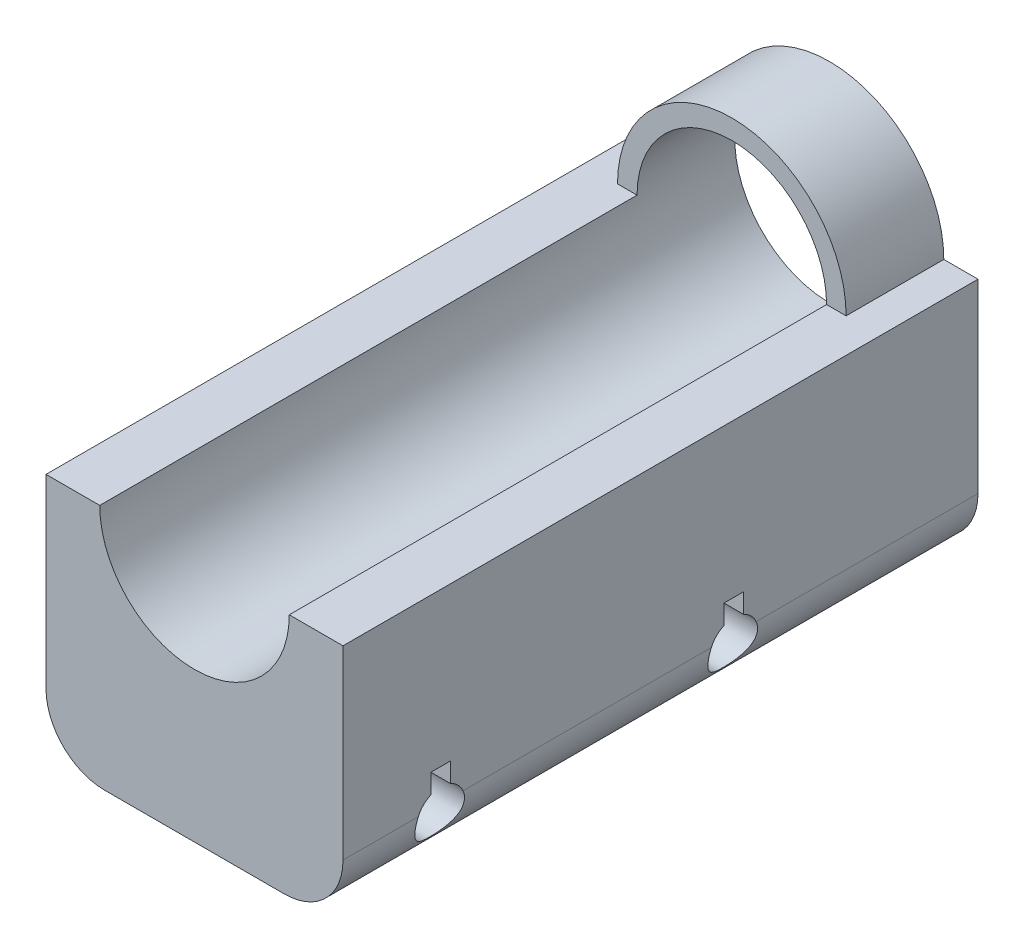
from build123d import *
from build123d.topology import SkipClean

# Parameters (mm, degrees)
BOSS_EXTRUDE1_DEPTH = 82.55
BOSS_EXTRUDE2_DEPTH = 12.7
CUT_EXTRUDE1_DEPTH  = 103.359557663


with BuildPart() as part:
    # Sketch1 → Boss-Extrude1 (new body)
    with BuildSketch(Plane.XY):
        with BuildLine():
            Line((31.623, 31.75), (38.608, 31.75))
            Line((38.608, 31.75), (38.608, 7.62))
            ThreePointArc((38.608, 7.62), (36.376153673, 2.231846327), (30.988, 0))
            Line((30.988, 0), (7.62, 0))
            ThreePointArc((7.62, 0), (2.231846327, 2.231846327), (0, 7.62))
            Line((0, 7.62), (0, 31.75))
            Line((0, 31.75), (6.985, 31.75))
            ThreePointArc((6.985, 31.75), (19.304, 19.431), (31.623, 31.75))
        make_face()
    extrude(amount=BOSS_EXTRUDE1_DEPTH)

    # Sketch2 → Boss-Extrude2 (add)
    with SkipClean():  # the faces are left unmerged after this step: merging them gives an invalid solid
        with BuildSketch(Plane(origin=(0, 0, 0), x_dir=(-1, 0, 0), z_dir=(0, 0, -1))):
            with BuildLine():
                Line((-4.445, 31.75), (-6.985, 31.75))
                ThreePointArc((-6.985, 31.75), (-19.304, 44.069), (-31.623, 31.75))
                Line((-31.623, 31.75), (-34.163, 31.75))
                ThreePointArc((-34.163, 31.75), (-19.304, 46.609), (-4.445, 31.75))
            make_face()
        extrude(amount=-BOSS_EXTRUDE2_DEPTH)

    # Sketch3 → Cut-Extrude1 (cut, through all)
    with SkipClean():  # the faces are left unmerged after this step: merging them gives an invalid solid
        with BuildSketch(Plane.ZY):
            with BuildLine():
                Line((30.48, 9.259935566), (30.48, 11.799935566))
                Line((30.48, 11.799935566), (33.02, 11.799935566))
                Line((33.02, 11.799935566), (33.02, 9.259935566))
                ThreePointArc((33.02, 9.259935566), (31.75, 3.175), (30.48, 9.259935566))
            make_face()
            with BuildLine():
                Line((71.12, 11.799935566), (71.12, 9.259935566))
                ThreePointArc((71.12, 9.259935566), (69.85, 3.175), (68.58, 9.259935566))
                Line((68.58, 9.259935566), (68.58, 11.799935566))
                Line((68.58, 11.799935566), (71.12, 11.799935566))
            make_face()
        extrude(amount=-CUT_EXTRUDE1_DEPTH, mode=Mode.SUBTRACT)


solid = part.part
